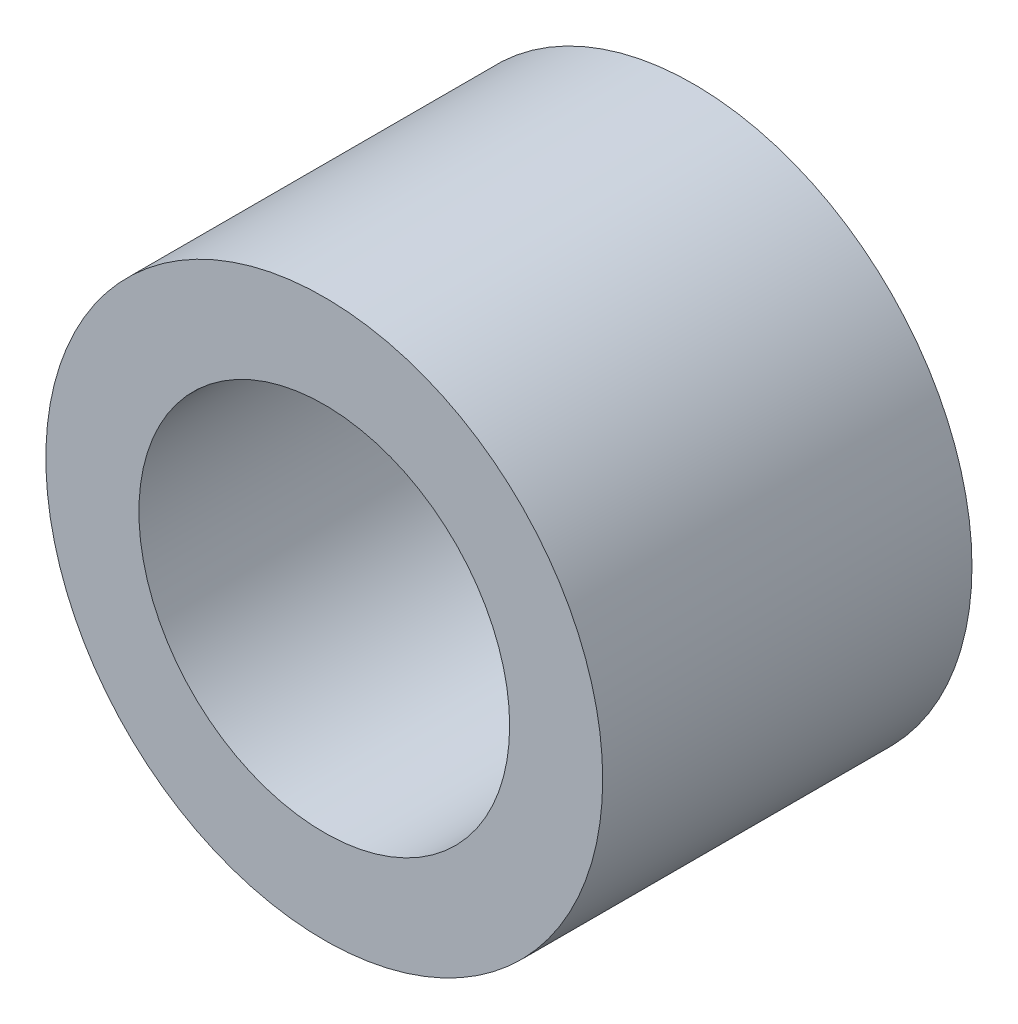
ISO-10303-21;
HEADER;
FILE_DESCRIPTION(('STEP AP214'),'2;1');
FILE_NAME('part.step','',(''),(''),'','','');
FILE_SCHEMA(('AUTOMOTIVE_DESIGN { 1 0 10303 214 1 1 1 1 }'));
ENDSEC;
DATA;
#1=APPLICATION_CONTEXT('core data for automotive mechanical design processes');
#2=APPLICATION_PROTOCOL_DEFINITION('international standard','automotive_design',2000,#1);
#3=PRODUCT_CONTEXT('',#1,'mechanical');
#4=PRODUCT('Part','Part','',(#3));
#5=PRODUCT_RELATED_PRODUCT_CATEGORY('part','',(#4));
#6=PRODUCT_DEFINITION_FORMATION('','',#4);
#7=PRODUCT_DEFINITION_CONTEXT('part definition',#1,'design');
#8=PRODUCT_DEFINITION('design','',#6,#7);
#9=PRODUCT_DEFINITION_SHAPE('','',#8);
#10=(LENGTH_UNIT() NAMED_UNIT(*) SI_UNIT(.MILLI.,.METRE.));
#11=(NAMED_UNIT(*) PLANE_ANGLE_UNIT() SI_UNIT($,.RADIAN.));
#12=(NAMED_UNIT(*) SI_UNIT($,.STERADIAN.) SOLID_ANGLE_UNIT());
#13=UNCERTAINTY_MEASURE_WITH_UNIT(LENGTH_MEASURE(1.E-05),#10,'distance_accuracy_value','');
#14=(GEOMETRIC_REPRESENTATION_CONTEXT(3) GLOBAL_UNCERTAINTY_ASSIGNED_CONTEXT((#13)) GLOBAL_UNIT_ASSIGNED_CONTEXT((#10,
#11,#12)) REPRESENTATION_CONTEXT('',''));
#15=CARTESIAN_POINT('',(0.,0.,0.));
#16=DIRECTION('',(0.,0.,1.));
#17=DIRECTION('',(1.,0.,0.));
#18=AXIS2_PLACEMENT_3D('',#15,#16,#17);
#19=CARTESIAN_POINT('',(0.,0.,3.175));
#20=DIRECTION('',(0.,0.,1.));
#21=DIRECTION('',(1.,0.,0.));
#22=AXIS2_PLACEMENT_3D('',#19,#20,#21);
#23=PLANE('',#22);
#24=CARTESIAN_POINT('',(0.,0.,3.175));
#25=DIRECTION('',(0.,0.,1.));
#26=DIRECTION('',(1.,0.,0.));
#27=AXIS2_PLACEMENT_3D('',#24,#25,#26);
#28=CIRCLE('',#27,4.7879);
#29=CARTESIAN_POINT('',(4.7879,0.,3.175));
#30=VERTEX_POINT('',#29);
#31=EDGE_CURVE('E10',#30,#30,#28,.T.);
#32=ORIENTED_EDGE('',*,*,#31,.T.);
#33=EDGE_LOOP('',(#32));
#34=FACE_BOUND('',#33,.T.);
#35=CARTESIAN_POINT('',(0.,0.,3.175));
#36=DIRECTION('',(0.,0.,1.));
#37=DIRECTION('',(1.,0.,0.));
#38=AXIS2_PLACEMENT_3D('',#35,#36,#37);
#39=CIRCLE('',#38,3.1877);
#40=CARTESIAN_POINT('',(3.1877,0.,3.175));
#41=VERTEX_POINT('',#40);
#42=EDGE_CURVE('E55',#41,#41,#39,.T.);
#43=ORIENTED_EDGE('',*,*,#42,.F.);
#44=EDGE_LOOP('',(#43));
#45=FACE_BOUND('',#44,.T.);
#46=ADVANCED_FACE('F41',(#34,#45),#23,.T.);
#47=CARTESIAN_POINT('',(0.,0.,-3.175));
#48=DIRECTION('',(0.,0.,1.));
#49=DIRECTION('',(1.,0.,0.));
#50=AXIS2_PLACEMENT_3D('',#47,#48,#49);
#51=PLANE('',#50);
#52=CARTESIAN_POINT('',(0.,0.,-3.175));
#53=DIRECTION('',(0.,0.,1.));
#54=DIRECTION('',(1.,0.,0.));
#55=AXIS2_PLACEMENT_3D('',#52,#53,#54);
#56=CIRCLE('',#55,4.7879);
#57=CARTESIAN_POINT('',(4.7879,0.,-3.175));
#58=VERTEX_POINT('',#57);
#59=EDGE_CURVE('E45',#58,#58,#56,.T.);
#60=ORIENTED_EDGE('',*,*,#59,.F.);
#61=EDGE_LOOP('',(#60));
#62=FACE_BOUND('',#61,.T.);
#63=CARTESIAN_POINT('',(0.,0.,-3.175));
#64=DIRECTION('',(0.,0.,1.));
#65=DIRECTION('',(1.,0.,0.));
#66=AXIS2_PLACEMENT_3D('',#63,#64,#65);
#67=CIRCLE('',#66,3.1877);
#68=CARTESIAN_POINT('',(3.1877,0.,-3.175));
#69=VERTEX_POINT('',#68);
#70=EDGE_CURVE('E57',#69,#69,#67,.T.);
#71=ORIENTED_EDGE('',*,*,#70,.T.);
#72=EDGE_LOOP('',(#71));
#73=FACE_BOUND('',#72,.T.);
#74=ADVANCED_FACE('F70',(#62,#73),#51,.F.);
#75=CARTESIAN_POINT('',(0.,0.,3.175));
#76=DIRECTION('',(0.,0.,-1.));
#77=DIRECTION('',(-1.,0.,0.));
#78=AXIS2_PLACEMENT_3D('',#75,#76,#77);
#79=CYLINDRICAL_SURFACE('',#78,4.7879);
#80=ORIENTED_EDGE('',*,*,#31,.F.);
#81=EDGE_LOOP('',(#80));
#82=FACE_BOUND('',#81,.T.);
#83=ORIENTED_EDGE('',*,*,#59,.T.);
#84=EDGE_LOOP('',(#83));
#85=FACE_BOUND('',#84,.T.);
#86=ADVANCED_FACE('F43',(#82,#85),#79,.T.);
#87=CARTESIAN_POINT('',(0.,0.,3.175));
#88=DIRECTION('',(0.,0.,-1.));
#89=DIRECTION('',(-1.,0.,0.));
#90=AXIS2_PLACEMENT_3D('',#87,#88,#89);
#91=CYLINDRICAL_SURFACE('',#90,3.1877);
#92=ORIENTED_EDGE('',*,*,#42,.T.);
#93=EDGE_LOOP('',(#92));
#94=FACE_BOUND('',#93,.T.);
#95=ORIENTED_EDGE('',*,*,#70,.F.);
#96=EDGE_LOOP('',(#95));
#97=FACE_BOUND('',#96,.T.);
#98=ADVANCED_FACE('F66',(#94,#97),#91,.F.);
#99=CLOSED_SHELL('',(#46,#74,#86,#98));
#100=MANIFOLD_SOLID_BREP('B2',#99);
#101=ADVANCED_BREP_SHAPE_REPRESENTATION('',(#18,#100),#14);
#102=SHAPE_DEFINITION_REPRESENTATION(#9,#101);
ENDSEC;
END-ISO-10303-21;
